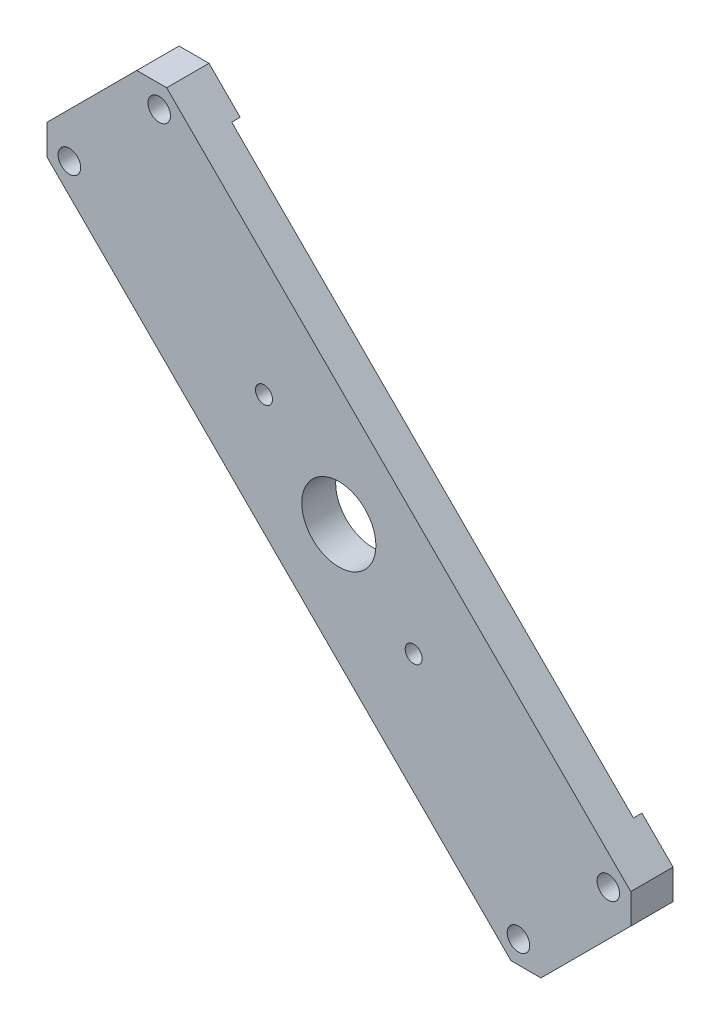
ISO-10303-21;
HEADER;
FILE_DESCRIPTION(('STEP AP214'),'2;1');
FILE_NAME('part.step','',(''),(''),'','','');
FILE_SCHEMA(('AUTOMOTIVE_DESIGN { 1 0 10303 214 1 1 1 1 }'));
ENDSEC;
DATA;
#1=APPLICATION_CONTEXT('core data for automotive mechanical design processes');
#2=APPLICATION_PROTOCOL_DEFINITION('international standard','automotive_design',2000,#1);
#3=PRODUCT_CONTEXT('',#1,'mechanical');
#4=PRODUCT('Part','Part','',(#3));
#5=PRODUCT_RELATED_PRODUCT_CATEGORY('part','',(#4));
#6=PRODUCT_DEFINITION_FORMATION('','',#4);
#7=PRODUCT_DEFINITION_CONTEXT('part definition',#1,'design');
#8=PRODUCT_DEFINITION('design','',#6,#7);
#9=PRODUCT_DEFINITION_SHAPE('','',#8);
#10=(LENGTH_UNIT() NAMED_UNIT(*) SI_UNIT(.MILLI.,.METRE.));
#11=(NAMED_UNIT(*) PLANE_ANGLE_UNIT() SI_UNIT($,.RADIAN.));
#12=(NAMED_UNIT(*) SI_UNIT($,.STERADIAN.) SOLID_ANGLE_UNIT());
#13=UNCERTAINTY_MEASURE_WITH_UNIT(LENGTH_MEASURE(1.E-05),#10,'distance_accuracy_value','');
#14=(GEOMETRIC_REPRESENTATION_CONTEXT(3) GLOBAL_UNCERTAINTY_ASSIGNED_CONTEXT((#13)) GLOBAL_UNIT_ASSIGNED_CONTEXT((#10,
#11,#12)) REPRESENTATION_CONTEXT('',''));
#15=CARTESIAN_POINT('',(0.,0.,0.));
#16=DIRECTION('',(0.,0.,1.));
#17=DIRECTION('',(1.,0.,0.));
#18=AXIS2_PLACEMENT_3D('',#15,#16,#17);
#19=CARTESIAN_POINT('',(-157.218600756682,-9.55237475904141,0.));
#20=DIRECTION('',(0.,0.,-1.));
#21=DIRECTION('',(-1.,0.,0.));
#22=AXIS2_PLACEMENT_3D('',#19,#20,#21);
#23=PLANE('',#22);
#24=DIRECTION('',(0.707106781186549,-0.707106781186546,0.));
#25=VECTOR('',#24,1.);
#26=CARTESIAN_POINT('',(-44.9653992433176,-193.647625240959,0.));
#27=LINE('',#26,#25);
#28=CARTESIAN_POINT('',(-188.649497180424,-49.9635273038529,0.));
#29=VERTEX_POINT('',#28);
#30=CARTESIAN_POINT('',(-179.293901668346,-59.3191228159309,0.));
#31=VERTEX_POINT('',#30);
#32=EDGE_CURVE('E135',#29,#31,#27,.T.);
#33=ORIENTED_EDGE('',*,*,#32,.F.);
#34=DIRECTION('',(0.,-1.,0.));
#35=VECTOR('',#34,1.);
#36=CARTESIAN_POINT('',(-188.649497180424,-9.55237475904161,0.));
#37=LINE('',#36,#35);
#38=CARTESIAN_POINT('',(-188.649497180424,-40.9832711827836,0.));
#39=VERTEX_POINT('',#38);
#40=EDGE_CURVE('E68',#29,#39,#37,.F.);
#41=ORIENTED_EDGE('',*,*,#40,.T.);
#42=DIRECTION('',(-0.707106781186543,-0.707106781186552,0.));
#43=VECTOR('',#42,1.);
#44=CARTESIAN_POINT('',(-193.139625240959,-45.4733992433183,0.));
#45=LINE('',#44,#43);
#46=CARTESIAN_POINT('',(-161.708728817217,-14.042502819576,0.));
#47=VERTEX_POINT('',#46);
#48=EDGE_CURVE('E199',#47,#39,#45,.T.);
#49=ORIENTED_EDGE('',*,*,#48,.F.);
#50=DIRECTION('',(-1.,0.,0.));
#51=VECTOR('',#50,1.);
#52=CARTESIAN_POINT('',(-157.218600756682,-14.042502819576,0.));
#53=LINE('',#52,#51);
#54=CARTESIAN_POINT('',(-152.728472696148,-14.042502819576,0.));
#55=VERTEX_POINT('',#54);
#56=EDGE_CURVE('E62',#47,#55,#53,.F.);
#57=ORIENTED_EDGE('',*,*,#56,.T.);
#58=DIRECTION('',(-0.707106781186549,0.707106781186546,0.));
#59=VECTOR('',#58,1.);
#60=CARTESIAN_POINT('',(-157.218600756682,-9.55237475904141,0.));
#61=LINE('',#60,#59);
#62=CARTESIAN_POINT('',(-143.372877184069,-23.3980983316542,0.));
#63=VERTEX_POINT('',#62);
#64=EDGE_CURVE('E159',#63,#55,#61,.T.);
#65=ORIENTED_EDGE('',*,*,#64,.F.);
#66=CARTESIAN_POINT('',(-101.092,-101.6,0.));
#67=DIRECTION('',(0.,0.,-1.));
#68=DIRECTION('',(-1.,0.,0.));
#69=AXIS2_PLACEMENT_3D('',#66,#67,#68);
#70=CIRCLE('',#69,88.9);
#71=EDGE_CURVE('E152',#31,#63,#70,.T.);
#72=ORIENTED_EDGE('',*,*,#71,.F.);
#73=EDGE_LOOP('',(#33,#41,#49,#57,#65,#72));
#74=FACE_BOUND('',#73,.T.);
#75=CARTESIAN_POINT('',(-181.914305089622,-47.7184632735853,0.));
#76=DIRECTION('',(0.,0.,1.));
#77=DIRECTION('',(1.,0.,0.));
#78=AXIS2_PLACEMENT_3D('',#75,#76,#77);
#79=CIRCLE('',#78,3.37819999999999);
#80=CARTESIAN_POINT('',(-178.536105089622,-47.7184632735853,0.));
#81=VERTEX_POINT('',#80);
#82=EDGE_CURVE('E193',#81,#81,#79,.T.);
#83=ORIENTED_EDGE('',*,*,#82,.T.);
#84=EDGE_LOOP('',(#83));
#85=FACE_BOUND('',#84,.T.);
#86=CARTESIAN_POINT('',(-154.973536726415,-20.7776949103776,0.));
#87=DIRECTION('',(0.,0.,1.));
#88=DIRECTION('',(1.,0.,0.));
#89=AXIS2_PLACEMENT_3D('',#86,#87,#88);
#90=CIRCLE('',#89,3.37819999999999);
#91=CARTESIAN_POINT('',(-151.595336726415,-20.7776949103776,0.));
#92=VERTEX_POINT('',#91);
#93=EDGE_CURVE('E187',#92,#92,#90,.T.);
#94=ORIENTED_EDGE('',*,*,#93,.T.);
#95=EDGE_LOOP('',(#94));
#96=FACE_BOUND('',#95,.T.);
#97=ADVANCED_FACE('F45',(#74,#85,#96),#23,.T.);
#98=CARTESIAN_POINT('',(-101.092,-101.6,12.7));
#99=DIRECTION('',(0.,0.,-1.));
#100=DIRECTION('',(-1.,0.,0.));
#101=AXIS2_PLACEMENT_3D('',#98,#99,#100);
#102=CYLINDRICAL_SURFACE('',#101,11.1124999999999);
#103=CARTESIAN_POINT('',(-101.092,-101.6,12.7));
#104=DIRECTION('',(0.,0.,1.));
#105=DIRECTION('',(1.,0.,0.));
#106=AXIS2_PLACEMENT_3D('',#103,#104,#105);
#107=CIRCLE('',#106,11.1124999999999);
#108=CARTESIAN_POINT('',(-89.9794999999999,-101.6,12.7));
#109=VERTEX_POINT('',#108);
#110=EDGE_CURVE('E174',#109,#109,#107,.T.);
#111=ORIENTED_EDGE('',*,*,#110,.T.);
#112=EDGE_LOOP('',(#111));
#113=FACE_BOUND('',#112,.T.);
#114=CARTESIAN_POINT('',(-101.092,-101.6,2.54));
#115=DIRECTION('',(0.,0.,-1.));
#116=DIRECTION('',(-1.,0.,0.));
#117=AXIS2_PLACEMENT_3D('',#114,#115,#116);
#118=CIRCLE('',#117,11.1124999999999);
#119=CARTESIAN_POINT('',(-112.2045,-101.6,2.54));
#120=VERTEX_POINT('',#119);
#121=EDGE_CURVE('E170',#120,#120,#118,.T.);
#122=ORIENTED_EDGE('',*,*,#121,.T.);
#123=EDGE_LOOP('',(#122));
#124=FACE_BOUND('',#123,.T.);
#125=ADVANCED_FACE('F353',(#113,#124),#102,.F.);
#126=CARTESIAN_POINT('',(-157.218600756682,-9.55237475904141,12.7));
#127=DIRECTION('',(0.,0.,-1.));
#128=DIRECTION('',(-1.,0.,0.));
#129=AXIS2_PLACEMENT_3D('',#126,#127,#128);
#130=PLANE('',#129);
#131=CARTESIAN_POINT('',(-123.542640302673,-79.1493596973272,12.7));
#132=DIRECTION('',(0.,0.,1.));
#133=DIRECTION('',(1.,0.,0.));
#134=AXIS2_PLACEMENT_3D('',#131,#132,#133);
#135=CIRCLE('',#134,2.55269999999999);
#136=CARTESIAN_POINT('',(-120.989940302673,-79.1493596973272,12.7));
#137=VERTEX_POINT('',#136);
#138=EDGE_CURVE('E267',#137,#137,#135,.T.);
#139=ORIENTED_EDGE('',*,*,#138,.F.);
#140=EDGE_LOOP('',(#139));
#141=FACE_BOUND('',#140,.T.);
#142=CARTESIAN_POINT('',(-78.641359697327,-124.050640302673,12.7));
#143=DIRECTION('',(0.,0.,1.));
#144=DIRECTION('',(1.,0.,0.));
#145=AXIS2_PLACEMENT_3D('',#142,#143,#144);
#146=CIRCLE('',#145,2.55269999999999);
#147=CARTESIAN_POINT('',(-76.088659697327,-124.050640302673,12.7));
#148=VERTEX_POINT('',#147);
#149=EDGE_CURVE('E257',#148,#148,#146,.T.);
#150=ORIENTED_EDGE('',*,*,#149,.F.);
#151=EDGE_LOOP('',(#150));
#152=FACE_BOUND('',#151,.T.);
#153=DIRECTION('',(0.707106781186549,-0.707106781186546,0.));
#154=VECTOR('',#153,1.);
#155=CARTESIAN_POINT('',(-44.9653992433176,-193.647625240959,12.7));
#156=LINE('',#155,#154);
#157=CARTESIAN_POINT('',(-188.649497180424,-49.9635273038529,12.7));
#158=VERTEX_POINT('',#157);
#159=CARTESIAN_POINT('',(-49.4555273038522,-189.157497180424,12.7));
#160=VERTEX_POINT('',#159);
#161=EDGE_CURVE('E205',#158,#160,#156,.T.);
#162=ORIENTED_EDGE('',*,*,#161,.T.);
#163=DIRECTION('',(-1.,0.,0.));
#164=VECTOR('',#163,1.);
#165=CARTESIAN_POINT('',(-40.475271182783,-189.157497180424,12.7));
#166=LINE('',#165,#164);
#167=CARTESIAN_POINT('',(-40.475271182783,-189.157497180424,12.7));
#168=VERTEX_POINT('',#167);
#169=EDGE_CURVE('E244',#160,#168,#166,.F.);
#170=ORIENTED_EDGE('',*,*,#169,.T.);
#171=DIRECTION('',(0.707106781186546,0.707106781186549,0.));
#172=VECTOR('',#171,1.);
#173=CARTESIAN_POINT('',(-9.04437475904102,-157.726600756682,12.7));
#174=LINE('',#173,#172);
#175=CARTESIAN_POINT('',(-13.5345028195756,-162.216728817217,12.7));
#176=VERTEX_POINT('',#175);
#177=EDGE_CURVE('E209',#168,#176,#174,.T.);
#178=ORIENTED_EDGE('',*,*,#177,.T.);
#179=DIRECTION('',(0.,-1.,0.));
#180=VECTOR('',#179,1.);
#181=CARTESIAN_POINT('',(-13.5345028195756,-153.236472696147,12.7));
#182=LINE('',#181,#180);
#183=CARTESIAN_POINT('',(-13.5345028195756,-153.236472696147,12.7));
#184=VERTEX_POINT('',#183);
#185=EDGE_CURVE('E238',#176,#184,#182,.F.);
#186=ORIENTED_EDGE('',*,*,#185,.T.);
#187=DIRECTION('',(-0.707106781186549,0.707106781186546,0.));
#188=VECTOR('',#187,1.);
#189=CARTESIAN_POINT('',(-157.218600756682,-9.55237475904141,12.7));
#190=LINE('',#189,#188);
#191=CARTESIAN_POINT('',(-152.728472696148,-14.042502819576,12.7));
#192=VERTEX_POINT('',#191);
#193=EDGE_CURVE('E212',#184,#192,#190,.T.);
#194=ORIENTED_EDGE('',*,*,#193,.T.);
#195=DIRECTION('',(1.,0.,0.));
#196=VECTOR('',#195,1.);
#197=CARTESIAN_POINT('',(-161.708728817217,-14.042502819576,12.7));
#198=LINE('',#197,#196);
#199=CARTESIAN_POINT('',(-161.708728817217,-14.042502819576,12.7));
#200=VERTEX_POINT('',#199);
#201=EDGE_CURVE('E240',#192,#200,#198,.F.);
#202=ORIENTED_EDGE('',*,*,#201,.T.);
#203=DIRECTION('',(-0.707106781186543,-0.707106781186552,0.));
#204=VECTOR('',#203,1.);
#205=CARTESIAN_POINT('',(-193.139625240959,-45.4733992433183,12.7));
#206=LINE('',#205,#204);
#207=CARTESIAN_POINT('',(-188.649497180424,-40.9832711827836,12.7));
#208=VERTEX_POINT('',#207);
#209=EDGE_CURVE('E202',#200,#208,#206,.T.);
#210=ORIENTED_EDGE('',*,*,#209,.T.);
#211=DIRECTION('',(0.,1.,0.));
#212=VECTOR('',#211,1.);
#213=CARTESIAN_POINT('',(-188.649497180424,-49.9635273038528,12.7));
#214=LINE('',#213,#212);
#215=EDGE_CURVE('E242',#208,#158,#214,.F.);
#216=ORIENTED_EDGE('',*,*,#215,.T.);
#217=EDGE_LOOP('',(#162,#170,#178,#186,#194,#202,#210,#216));
#218=FACE_BOUND('',#217,.T.);
#219=CARTESIAN_POINT('',(-181.914305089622,-47.7184632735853,12.7));
#220=DIRECTION('',(0.,0.,1.));
#221=DIRECTION('',(1.,0.,0.));
#222=AXIS2_PLACEMENT_3D('',#219,#220,#221);
#223=CIRCLE('',#222,3.37819999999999);
#224=CARTESIAN_POINT('',(-178.536105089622,-47.7184632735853,12.7));
#225=VERTEX_POINT('',#224);
#226=EDGE_CURVE('E196',#225,#225,#223,.T.);
#227=ORIENTED_EDGE('',*,*,#226,.F.);
#228=EDGE_LOOP('',(#227));
#229=FACE_BOUND('',#228,.T.);
#230=CARTESIAN_POINT('',(-154.973536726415,-20.7776949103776,12.7));
#231=DIRECTION('',(0.,0.,1.));
#232=DIRECTION('',(1.,0.,0.));
#233=AXIS2_PLACEMENT_3D('',#230,#231,#232);
#234=CIRCLE('',#233,3.37819999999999);
#235=CARTESIAN_POINT('',(-151.595336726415,-20.7776949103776,12.7));
#236=VERTEX_POINT('',#235);
#237=EDGE_CURVE('E190',#236,#236,#234,.T.);
#238=ORIENTED_EDGE('',*,*,#237,.F.);
#239=EDGE_LOOP('',(#238));
#240=FACE_BOUND('',#239,.T.);
#241=CARTESIAN_POINT('',(-47.2104632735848,-182.422305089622,12.7));
#242=DIRECTION('',(0.,0.,1.));
#243=DIRECTION('',(1.,0.,0.));
#244=AXIS2_PLACEMENT_3D('',#241,#242,#243);
#245=CIRCLE('',#244,3.3782);
#246=CARTESIAN_POINT('',(-43.8322632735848,-182.422305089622,12.7));
#247=VERTEX_POINT('',#246);
#248=EDGE_CURVE('E184',#247,#247,#245,.T.);
#249=ORIENTED_EDGE('',*,*,#248,.F.);
#250=EDGE_LOOP('',(#249));
#251=FACE_BOUND('',#250,.T.);
#252=CARTESIAN_POINT('',(-20.2696949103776,-155.481536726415,12.7));
#253=DIRECTION('',(0.,0.,1.));
#254=DIRECTION('',(1.,0.,0.));
#255=AXIS2_PLACEMENT_3D('',#252,#253,#254);
#256=CIRCLE('',#255,3.37819999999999);
#257=CARTESIAN_POINT('',(-16.8914949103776,-155.481536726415,12.7));
#258=VERTEX_POINT('',#257);
#259=EDGE_CURVE('E178',#258,#258,#256,.T.);
#260=ORIENTED_EDGE('',*,*,#259,.F.);
#261=EDGE_LOOP('',(#260));
#262=FACE_BOUND('',#261,.T.);
#263=ORIENTED_EDGE('',*,*,#110,.F.);
#264=EDGE_LOOP('',(#263));
#265=FACE_BOUND('',#264,.T.);
#266=ADVANCED_FACE('F325',(#141,#152,#218,#229,#240,#251,#262,#265),#130,.F.);
#267=DIRECTION('',(0.707106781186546,0.707106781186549,0.));
#268=VECTOR('',#267,1.);
#269=CARTESIAN_POINT('',(-9.04437475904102,-157.726600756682,0.));
#270=LINE('',#269,#268);
#271=CARTESIAN_POINT('',(-40.475271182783,-189.157497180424,0.));
#272=VERTEX_POINT('',#271);
#273=CARTESIAN_POINT('',(-13.5345028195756,-162.216728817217,0.));
#274=VERTEX_POINT('',#273);
#275=EDGE_CURVE('E145',#272,#274,#270,.T.);
#276=ORIENTED_EDGE('',*,*,#275,.F.);
#277=DIRECTION('',(1.,0.,0.));
#278=VECTOR('',#277,1.);
#279=CARTESIAN_POINT('',(-157.218600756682,-189.157497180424,0.));
#280=LINE('',#279,#278);
#281=CARTESIAN_POINT('',(-49.4555273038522,-189.157497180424,0.));
#282=VERTEX_POINT('',#281);
#283=EDGE_CURVE('E233',#272,#282,#280,.F.);
#284=ORIENTED_EDGE('',*,*,#283,.T.);
#285=CARTESIAN_POINT('',(-58.8111228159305,-179.801901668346,0.));
#286=VERTEX_POINT('',#285);
#287=EDGE_CURVE('E146',#286,#282,#27,.T.);
#288=ORIENTED_EDGE('',*,*,#287,.F.);
#289=CARTESIAN_POINT('',(-22.890098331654,-143.880877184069,0.));
#290=VERTEX_POINT('',#289);
#291=EDGE_CURVE('E161',#290,#286,#70,.T.);
#292=ORIENTED_EDGE('',*,*,#291,.F.);
#293=CARTESIAN_POINT('',(-13.5345028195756,-153.236472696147,0.));
#294=VERTEX_POINT('',#293);
#295=EDGE_CURVE('E206',#294,#290,#61,.T.);
#296=ORIENTED_EDGE('',*,*,#295,.F.);
#297=DIRECTION('',(0.,1.,0.));
#298=VECTOR('',#297,1.);
#299=CARTESIAN_POINT('',(-13.5345028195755,-9.55237475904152,0.));
#300=LINE('',#299,#298);
#301=EDGE_CURVE('E231',#294,#274,#300,.F.);
#302=ORIENTED_EDGE('',*,*,#301,.T.);
#303=EDGE_LOOP('',(#276,#284,#288,#292,#296,#302));
#304=FACE_BOUND('',#303,.T.);
#305=CARTESIAN_POINT('',(-20.2696949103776,-155.481536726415,0.));
#306=DIRECTION('',(0.,0.,1.));
#307=DIRECTION('',(1.,0.,0.));
#308=AXIS2_PLACEMENT_3D('',#305,#306,#307);
#309=CIRCLE('',#308,3.37819999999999);
#310=CARTESIAN_POINT('',(-16.8914949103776,-155.481536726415,0.));
#311=VERTEX_POINT('',#310);
#312=EDGE_CURVE('E177',#311,#311,#309,.T.);
#313=ORIENTED_EDGE('',*,*,#312,.T.);
#314=EDGE_LOOP('',(#313));
#315=FACE_BOUND('',#314,.T.);
#316=CARTESIAN_POINT('',(-47.2104632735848,-182.422305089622,0.));
#317=DIRECTION('',(0.,0.,1.));
#318=DIRECTION('',(1.,0.,0.));
#319=AXIS2_PLACEMENT_3D('',#316,#317,#318);
#320=CIRCLE('',#319,3.3782);
#321=CARTESIAN_POINT('',(-43.8322632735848,-182.422305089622,0.));
#322=VERTEX_POINT('',#321);
#323=EDGE_CURVE('E181',#322,#322,#320,.T.);
#324=ORIENTED_EDGE('',*,*,#323,.T.);
#325=EDGE_LOOP('',(#324));
#326=FACE_BOUND('',#325,.T.);
#327=ADVANCED_FACE('F313',(#304,#315,#326),#23,.T.);
#328=CARTESIAN_POINT('',(-193.139625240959,-45.4733992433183,12.7));
#329=DIRECTION('',(0.707106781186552,-0.707106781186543,0.));
#330=DIRECTION('',(0.707106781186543,0.707106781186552,0.));
#331=AXIS2_PLACEMENT_3D('',#328,#329,#330);
#332=PLANE('',#331);
#333=ORIENTED_EDGE('',*,*,#48,.T.);
#334=DIRECTION('',(0.,0.,1.));
#335=VECTOR('',#334,1.);
#336=CARTESIAN_POINT('',(-188.649497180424,-40.9832711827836,12.7));
#337=LINE('',#336,#335);
#338=EDGE_CURVE('E251',#39,#208,#337,.T.);
#339=ORIENTED_EDGE('',*,*,#338,.T.);
#340=ORIENTED_EDGE('',*,*,#209,.F.);
#341=DIRECTION('',(0.,0.,-1.));
#342=VECTOR('',#341,1.);
#343=CARTESIAN_POINT('',(-161.708728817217,-14.042502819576,12.7));
#344=LINE('',#343,#342);
#345=EDGE_CURVE('E248',#200,#47,#344,.T.);
#346=ORIENTED_EDGE('',*,*,#345,.T.);
#347=EDGE_LOOP('',(#333,#339,#340,#346));
#348=FACE_BOUND('',#347,.T.);
#349=ADVANCED_FACE('F340',(#348),#332,.F.);
#350=CARTESIAN_POINT('',(-44.9653992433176,-193.647625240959,12.7));
#351=DIRECTION('',(0.707106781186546,0.707106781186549,0.));
#352=DIRECTION('',(-0.707106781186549,0.707106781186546,0.));
#353=AXIS2_PLACEMENT_3D('',#350,#351,#352);
#354=PLANE('',#353);
#355=ORIENTED_EDGE('',*,*,#287,.T.);
#356=DIRECTION('',(0.,0.,1.));
#357=VECTOR('',#356,1.);
#358=CARTESIAN_POINT('',(-49.4555273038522,-189.157497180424,12.7));
#359=LINE('',#358,#357);
#360=EDGE_CURVE('E236',#282,#160,#359,.T.);
#361=ORIENTED_EDGE('',*,*,#360,.T.);
#362=ORIENTED_EDGE('',*,*,#161,.F.);
#363=DIRECTION('',(0.,0.,-1.));
#364=VECTOR('',#363,1.);
#365=CARTESIAN_POINT('',(-188.649497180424,-49.9635273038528,12.7));
#366=LINE('',#365,#364);
#367=EDGE_CURVE('E143',#158,#29,#366,.T.);
#368=ORIENTED_EDGE('',*,*,#367,.T.);
#369=ORIENTED_EDGE('',*,*,#32,.T.);
#370=DIRECTION('',(0.,0.,-1.));
#371=VECTOR('',#370,1.);
#372=CARTESIAN_POINT('',(-179.293901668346,-59.3191228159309,2.54));
#373=LINE('',#372,#371);
#374=CARTESIAN_POINT('',(-179.293901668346,-59.3191228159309,2.54));
#375=VERTEX_POINT('',#374);
#376=EDGE_CURVE('E140',#31,#375,#373,.F.);
#377=ORIENTED_EDGE('',*,*,#376,.T.);
#378=DIRECTION('',(-0.707106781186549,0.707106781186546,0.));
#379=VECTOR('',#378,1.);
#380=CARTESIAN_POINT('',(-44.9653992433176,-193.647625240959,2.54));
#381=LINE('',#380,#379);
#382=CARTESIAN_POINT('',(-58.8111228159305,-179.801901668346,2.54));
#383=VERTEX_POINT('',#382);
#384=EDGE_CURVE('E156',#383,#375,#381,.T.);
#385=ORIENTED_EDGE('',*,*,#384,.F.);
#386=DIRECTION('',(0.,0.,-1.));
#387=VECTOR('',#386,1.);
#388=CARTESIAN_POINT('',(-58.8111228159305,-179.801901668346,2.54));
#389=LINE('',#388,#387);
#390=EDGE_CURVE('E155',#383,#286,#389,.T.);
#391=ORIENTED_EDGE('',*,*,#390,.T.);
#392=EDGE_LOOP('',(#355,#361,#362,#368,#369,#377,#385,#391));
#393=FACE_BOUND('',#392,.T.);
#394=ADVANCED_FACE('F138',(#393),#354,.F.);
#395=CARTESIAN_POINT('',(-9.04437475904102,-157.726600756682,12.7));
#396=DIRECTION('',(-0.707106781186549,0.707106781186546,0.));
#397=DIRECTION('',(-0.707106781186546,-0.707106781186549,0.));
#398=AXIS2_PLACEMENT_3D('',#395,#396,#397);
#399=PLANE('',#398);
#400=ORIENTED_EDGE('',*,*,#177,.F.);
#401=DIRECTION('',(0.,0.,-1.));
#402=VECTOR('',#401,1.);
#403=CARTESIAN_POINT('',(-40.475271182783,-189.157497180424,12.7));
#404=LINE('',#403,#402);
#405=EDGE_CURVE('E228',#168,#272,#404,.T.);
#406=ORIENTED_EDGE('',*,*,#405,.T.);
#407=ORIENTED_EDGE('',*,*,#275,.T.);
#408=DIRECTION('',(0.,0.,1.));
#409=VECTOR('',#408,1.);
#410=CARTESIAN_POINT('',(-13.5345028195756,-162.216728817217,12.7));
#411=LINE('',#410,#409);
#412=EDGE_CURVE('E226',#274,#176,#411,.T.);
#413=ORIENTED_EDGE('',*,*,#412,.T.);
#414=EDGE_LOOP('',(#400,#406,#407,#413));
#415=FACE_BOUND('',#414,.T.);
#416=ADVANCED_FACE('F321',(#415),#399,.F.);
#417=CARTESIAN_POINT('',(-157.218600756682,-9.55237475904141,12.7));
#418=DIRECTION('',(-0.707106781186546,-0.707106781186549,0.));
#419=DIRECTION('',(0.707106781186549,-0.707106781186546,0.));
#420=AXIS2_PLACEMENT_3D('',#417,#418,#419);
#421=PLANE('',#420);
#422=ORIENTED_EDGE('',*,*,#64,.T.);
#423=DIRECTION('',(0.,0.,1.));
#424=VECTOR('',#423,1.);
#425=CARTESIAN_POINT('',(-152.728472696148,-14.042502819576,12.7));
#426=LINE('',#425,#424);
#427=EDGE_CURVE('E11',#55,#192,#426,.T.);
#428=ORIENTED_EDGE('',*,*,#427,.T.);
#429=ORIENTED_EDGE('',*,*,#193,.F.);
#430=DIRECTION('',(0.,0.,-1.));
#431=VECTOR('',#430,1.);
#432=CARTESIAN_POINT('',(-13.5345028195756,-153.236472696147,12.7));
#433=LINE('',#432,#431);
#434=EDGE_CURVE('E54',#184,#294,#433,.T.);
#435=ORIENTED_EDGE('',*,*,#434,.T.);
#436=ORIENTED_EDGE('',*,*,#295,.T.);
#437=DIRECTION('',(0.,0.,-1.));
#438=VECTOR('',#437,1.);
#439=CARTESIAN_POINT('',(-22.890098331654,-143.880877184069,2.54));
#440=LINE('',#439,#438);
#441=CARTESIAN_POINT('',(-22.890098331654,-143.880877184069,2.54));
#442=VERTEX_POINT('',#441);
#443=EDGE_CURVE('E215',#290,#442,#440,.F.);
#444=ORIENTED_EDGE('',*,*,#443,.T.);
#445=DIRECTION('',(0.707106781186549,-0.707106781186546,0.));
#446=VECTOR('',#445,1.);
#447=CARTESIAN_POINT('',(-157.218600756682,-9.55237475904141,2.54));
#448=LINE('',#447,#446);
#449=CARTESIAN_POINT('',(-143.372877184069,-23.3980983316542,2.54));
#450=VERTEX_POINT('',#449);
#451=EDGE_CURVE('E168',#450,#442,#448,.T.);
#452=ORIENTED_EDGE('',*,*,#451,.F.);
#453=DIRECTION('',(0.,0.,-1.));
#454=VECTOR('',#453,1.);
#455=CARTESIAN_POINT('',(-143.372877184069,-23.3980983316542,2.54));
#456=LINE('',#455,#454);
#457=EDGE_CURVE('E224',#450,#63,#456,.T.);
#458=ORIENTED_EDGE('',*,*,#457,.T.);
#459=EDGE_LOOP('',(#422,#428,#429,#435,#436,#444,#452,#458));
#460=FACE_BOUND('',#459,.T.);
#461=ADVANCED_FACE('F331',(#460),#421,.F.);
#462=CARTESIAN_POINT('',(-181.914305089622,-47.7184632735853,12.7));
#463=DIRECTION('',(0.,0.,-1.));
#464=DIRECTION('',(-1.,0.,0.));
#465=AXIS2_PLACEMENT_3D('',#462,#463,#464);
#466=CYLINDRICAL_SURFACE('',#465,3.37819999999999);
#467=ORIENTED_EDGE('',*,*,#226,.T.);
#468=EDGE_LOOP('',(#467));
#469=FACE_BOUND('',#468,.T.);
#470=ORIENTED_EDGE('',*,*,#82,.F.);
#471=EDGE_LOOP('',(#470));
#472=FACE_BOUND('',#471,.T.);
#473=ADVANCED_FACE('F376',(#469,#472),#466,.F.);
#474=CARTESIAN_POINT('',(-154.973536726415,-20.7776949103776,12.7));
#475=DIRECTION('',(0.,0.,-1.));
#476=DIRECTION('',(-1.,0.,0.));
#477=AXIS2_PLACEMENT_3D('',#474,#475,#476);
#478=CYLINDRICAL_SURFACE('',#477,3.37819999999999);
#479=ORIENTED_EDGE('',*,*,#237,.T.);
#480=EDGE_LOOP('',(#479));
#481=FACE_BOUND('',#480,.T.);
#482=ORIENTED_EDGE('',*,*,#93,.F.);
#483=EDGE_LOOP('',(#482));
#484=FACE_BOUND('',#483,.T.);
#485=ADVANCED_FACE('F379',(#481,#484),#478,.F.);
#486=CARTESIAN_POINT('',(-47.2104632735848,-182.422305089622,12.7));
#487=DIRECTION('',(0.,0.,-1.));
#488=DIRECTION('',(-1.,0.,0.));
#489=AXIS2_PLACEMENT_3D('',#486,#487,#488);
#490=CYLINDRICAL_SURFACE('',#489,3.3782);
#491=ORIENTED_EDGE('',*,*,#248,.T.);
#492=EDGE_LOOP('',(#491));
#493=FACE_BOUND('',#492,.T.);
#494=ORIENTED_EDGE('',*,*,#323,.F.);
#495=EDGE_LOOP('',(#494));
#496=FACE_BOUND('',#495,.T.);
#497=ADVANCED_FACE('F383',(#493,#496),#490,.F.);
#498=CARTESIAN_POINT('',(-20.2696949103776,-155.481536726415,12.7));
#499=DIRECTION('',(0.,0.,-1.));
#500=DIRECTION('',(-1.,0.,0.));
#501=AXIS2_PLACEMENT_3D('',#498,#499,#500);
#502=CYLINDRICAL_SURFACE('',#501,3.37819999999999);
#503=ORIENTED_EDGE('',*,*,#259,.T.);
#504=EDGE_LOOP('',(#503));
#505=FACE_BOUND('',#504,.T.);
#506=ORIENTED_EDGE('',*,*,#312,.F.);
#507=EDGE_LOOP('',(#506));
#508=FACE_BOUND('',#507,.T.);
#509=ADVANCED_FACE('F387',(#505,#508),#502,.F.);
#510=CARTESIAN_POINT('',(-101.092,-101.6,2.54));
#511=DIRECTION('',(0.,0.,-1.));
#512=DIRECTION('',(-1.,0.,0.));
#513=AXIS2_PLACEMENT_3D('',#510,#511,#512);
#514=CYLINDRICAL_SURFACE('',#513,88.9);
#515=CARTESIAN_POINT('',(-101.092,-101.6,2.54));
#516=DIRECTION('',(0.,0.,-1.));
#517=DIRECTION('',(-1.,0.,0.));
#518=AXIS2_PLACEMENT_3D('',#515,#516,#517);
#519=CIRCLE('',#518,88.9);
#520=EDGE_CURVE('E160',#442,#383,#519,.T.);
#521=ORIENTED_EDGE('',*,*,#520,.F.);
#522=ORIENTED_EDGE('',*,*,#443,.F.);
#523=ORIENTED_EDGE('',*,*,#291,.T.);
#524=ORIENTED_EDGE('',*,*,#390,.F.);
#525=EDGE_LOOP('',(#521,#522,#523,#524));
#526=FACE_BOUND('',#525,.T.);
#527=ADVANCED_FACE('F390',(#526),#514,.F.);
#528=ORIENTED_EDGE('',*,*,#71,.T.);
#529=ORIENTED_EDGE('',*,*,#457,.F.);
#530=EDGE_CURVE('E154',#375,#450,#519,.T.);
#531=ORIENTED_EDGE('',*,*,#530,.F.);
#532=ORIENTED_EDGE('',*,*,#376,.F.);
#533=EDGE_LOOP('',(#528,#529,#531,#532));
#534=FACE_BOUND('',#533,.T.);
#535=ADVANCED_FACE('F150',(#534),#514,.F.);
#536=CARTESIAN_POINT('',(-101.092,-101.6,2.54));
#537=DIRECTION('',(0.,0.,-1.));
#538=DIRECTION('',(-1.,0.,0.));
#539=AXIS2_PLACEMENT_3D('',#536,#537,#538);
#540=PLANE('',#539);
#541=CARTESIAN_POINT('',(-123.542640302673,-79.1493596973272,2.54));
#542=DIRECTION('',(0.,0.,-1.));
#543=DIRECTION('',(-1.,0.,0.));
#544=AXIS2_PLACEMENT_3D('',#541,#542,#543);
#545=CIRCLE('',#544,2.55269999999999);
#546=CARTESIAN_POINT('',(-126.095340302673,-79.1493596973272,2.54));
#547=VERTEX_POINT('',#546);
#548=EDGE_CURVE('E49',#547,#547,#545,.T.);
#549=ORIENTED_EDGE('',*,*,#548,.F.);
#550=EDGE_LOOP('',(#549));
#551=FACE_BOUND('',#550,.T.);
#552=CARTESIAN_POINT('',(-78.641359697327,-124.050640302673,2.54));
#553=DIRECTION('',(0.,0.,-1.));
#554=DIRECTION('',(-1.,0.,0.));
#555=AXIS2_PLACEMENT_3D('',#552,#553,#554);
#556=CIRCLE('',#555,2.55269999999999);
#557=CARTESIAN_POINT('',(-81.194059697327,-124.050640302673,2.54));
#558=VERTEX_POINT('',#557);
#559=EDGE_CURVE('E254',#558,#558,#556,.T.);
#560=ORIENTED_EDGE('',*,*,#559,.F.);
#561=EDGE_LOOP('',(#560));
#562=FACE_BOUND('',#561,.T.);
#563=CARTESIAN_POINT('',(-134.767960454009,-45.4733992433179,2.54));
#564=DIRECTION('',(0.,0.,-1.));
#565=DIRECTION('',(-1.,0.,0.));
#566=AXIS2_PLACEMENT_3D('',#563,#564,#565);
#567=CIRCLE('',#566,4.06400000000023);
#568=CARTESIAN_POINT('',(-138.831960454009,-45.4733992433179,2.54));
#569=VERTEX_POINT('',#568);
#570=EDGE_CURVE('E272',#569,#569,#567,.T.);
#571=ORIENTED_EDGE('',*,*,#570,.F.);
#572=EDGE_LOOP('',(#571));
#573=FACE_BOUND('',#572,.T.);
#574=CARTESIAN_POINT('',(-157.218600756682,-67.9240395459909,2.54));
#575=DIRECTION('',(0.,0.,-1.));
#576=DIRECTION('',(-1.,0.,0.));
#577=AXIS2_PLACEMENT_3D('',#574,#575,#576);
#578=CIRCLE('',#577,4.06400000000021);
#579=CARTESIAN_POINT('',(-161.282600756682,-67.9240395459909,2.54));
#580=VERTEX_POINT('',#579);
#581=EDGE_CURVE('E278',#580,#580,#578,.T.);
#582=ORIENTED_EDGE('',*,*,#581,.F.);
#583=EDGE_LOOP('',(#582));
#584=FACE_BOUND('',#583,.T.);
#585=CARTESIAN_POINT('',(-44.9653992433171,-135.275960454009,2.54));
#586=DIRECTION('',(0.,0.,-1.));
#587=DIRECTION('',(-1.,0.,0.));
#588=AXIS2_PLACEMENT_3D('',#585,#586,#587);
#589=CIRCLE('',#588,4.06400000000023);
#590=CARTESIAN_POINT('',(-49.0293992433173,-135.275960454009,2.54));
#591=VERTEX_POINT('',#590);
#592=EDGE_CURVE('E284',#591,#591,#589,.T.);
#593=ORIENTED_EDGE('',*,*,#592,.F.);
#594=EDGE_LOOP('',(#593));
#595=FACE_BOUND('',#594,.T.);
#596=CARTESIAN_POINT('',(-67.4160395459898,-157.726600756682,2.54));
#597=DIRECTION('',(0.,0.,-1.));
#598=DIRECTION('',(-1.,0.,0.));
#599=AXIS2_PLACEMENT_3D('',#596,#597,#598);
#600=CIRCLE('',#599,4.06400000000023);
#601=CARTESIAN_POINT('',(-71.4800395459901,-157.726600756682,2.54));
#602=VERTEX_POINT('',#601);
#603=EDGE_CURVE('E256',#602,#602,#600,.T.);
#604=ORIENTED_EDGE('',*,*,#603,.F.);
#605=EDGE_LOOP('',(#604));
#606=FACE_BOUND('',#605,.T.);
#607=ORIENTED_EDGE('',*,*,#121,.F.);
#608=EDGE_LOOP('',(#607));
#609=FACE_BOUND('',#608,.T.);
#610=ORIENTED_EDGE('',*,*,#384,.T.);
#611=ORIENTED_EDGE('',*,*,#530,.T.);
#612=ORIENTED_EDGE('',*,*,#451,.T.);
#613=ORIENTED_EDGE('',*,*,#520,.T.);
#614=EDGE_LOOP('',(#610,#611,#612,#613));
#615=FACE_BOUND('',#614,.T.);
#616=ADVANCED_FACE('F298',(#551,#562,#573,#584,#595,#606,#609,#615),#540,.T.);
#617=CARTESIAN_POINT('',(-40.475271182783,-189.157497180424,12.7));
#618=DIRECTION('',(0.,1.,0.));
#619=DIRECTION('',(0.,0.,1.));
#620=AXIS2_PLACEMENT_3D('',#617,#618,#619);
#621=PLANE('',#620);
#622=ORIENTED_EDGE('',*,*,#169,.F.);
#623=ORIENTED_EDGE('',*,*,#360,.F.);
#624=ORIENTED_EDGE('',*,*,#283,.F.);
#625=ORIENTED_EDGE('',*,*,#405,.F.);
#626=EDGE_LOOP('',(#622,#623,#624,#625));
#627=FACE_BOUND('',#626,.T.);
#628=ADVANCED_FACE('F301',(#627),#621,.F.);
#629=CARTESIAN_POINT('',(-188.649497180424,-49.9635273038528,12.7));
#630=DIRECTION('',(1.,0.,0.));
#631=DIRECTION('',(0.,1.,0.));
#632=AXIS2_PLACEMENT_3D('',#629,#630,#631);
#633=PLANE('',#632);
#634=ORIENTED_EDGE('',*,*,#215,.F.);
#635=ORIENTED_EDGE('',*,*,#338,.F.);
#636=ORIENTED_EDGE('',*,*,#40,.F.);
#637=ORIENTED_EDGE('',*,*,#367,.F.);
#638=EDGE_LOOP('',(#634,#635,#636,#637));
#639=FACE_BOUND('',#638,.T.);
#640=ADVANCED_FACE('F344',(#639),#633,.F.);
#641=CARTESIAN_POINT('',(-161.708728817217,-14.042502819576,12.7));
#642=DIRECTION('',(0.,-1.,0.));
#643=DIRECTION('',(0.,0.,-1.));
#644=AXIS2_PLACEMENT_3D('',#641,#642,#643);
#645=PLANE('',#644);
#646=ORIENTED_EDGE('',*,*,#201,.F.);
#647=ORIENTED_EDGE('',*,*,#427,.F.);
#648=ORIENTED_EDGE('',*,*,#56,.F.);
#649=ORIENTED_EDGE('',*,*,#345,.F.);
#650=EDGE_LOOP('',(#646,#647,#648,#649));
#651=FACE_BOUND('',#650,.T.);
#652=ADVANCED_FACE('F338',(#651),#645,.F.);
#653=CARTESIAN_POINT('',(-13.5345028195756,-153.236472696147,12.7));
#654=DIRECTION('',(-1.,0.,0.));
#655=DIRECTION('',(0.,-1.,0.));
#656=AXIS2_PLACEMENT_3D('',#653,#654,#655);
#657=PLANE('',#656);
#658=ORIENTED_EDGE('',*,*,#185,.F.);
#659=ORIENTED_EDGE('',*,*,#412,.F.);
#660=ORIENTED_EDGE('',*,*,#301,.F.);
#661=ORIENTED_EDGE('',*,*,#434,.F.);
#662=EDGE_LOOP('',(#658,#659,#660,#661));
#663=FACE_BOUND('',#662,.T.);
#664=ADVANCED_FACE('F47',(#663),#657,.F.);
#665=CARTESIAN_POINT('',(-67.4160395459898,-157.726600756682,3.302));
#666=DIRECTION('',(0.,0.,-1.));
#667=DIRECTION('',(-1.,0.,0.));
#668=AXIS2_PLACEMENT_3D('',#665,#666,#667);
#669=CYLINDRICAL_SURFACE('',#668,4.06400000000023);
#670=CARTESIAN_POINT('',(-67.4160395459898,-157.726600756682,3.302));
#671=DIRECTION('',(0.,0.,-1.));
#672=DIRECTION('',(-1.,0.,0.));
#673=AXIS2_PLACEMENT_3D('',#670,#671,#672);
#674=CIRCLE('',#673,4.06400000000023);
#675=CARTESIAN_POINT('',(-71.4800395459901,-157.726600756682,3.302));
#676=VERTEX_POINT('',#675);
#677=EDGE_CURVE('E261',#676,#676,#674,.T.);
#678=CARTESIAN_POINT('',(-71.4800395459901,-157.726600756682,3.302));
#679=CARTESIAN_POINT('',(-71.4800395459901,-157.726600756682,3.2940625));
#680=CARTESIAN_POINT('',(-71.4800395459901,-157.726600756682,3.286125));
#681=CARTESIAN_POINT('',(-71.4800395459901,-157.726600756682,3.27025));
#682=CARTESIAN_POINT('',(-71.4800395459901,-157.726600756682,3.2623125));
#683=CARTESIAN_POINT('',(-71.4800395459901,-157.726600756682,3.2464375));
#684=CARTESIAN_POINT('',(-71.4800395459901,-157.726600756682,3.2385));
#685=CARTESIAN_POINT('',(-71.4800395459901,-157.726600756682,3.222625));
#686=CARTESIAN_POINT('',(-71.4800395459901,-157.726600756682,3.2146875));
#687=CARTESIAN_POINT('',(-71.4800395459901,-157.726600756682,3.1988125));
#688=CARTESIAN_POINT('',(-71.4800395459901,-157.726600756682,3.190875));
#689=CARTESIAN_POINT('',(-71.4800395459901,-157.726600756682,3.175));
#690=CARTESIAN_POINT('',(-71.4800395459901,-157.726600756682,3.1670625));
#691=CARTESIAN_POINT('',(-71.4800395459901,-157.726600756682,3.1511875));
#692=CARTESIAN_POINT('',(-71.4800395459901,-157.726600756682,3.14325));
#693=CARTESIAN_POINT('',(-71.4800395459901,-157.726600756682,3.127375));
#694=CARTESIAN_POINT('',(-71.4800395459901,-157.726600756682,3.1194375));
#695=CARTESIAN_POINT('',(-71.4800395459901,-157.726600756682,3.1035625));
#696=CARTESIAN_POINT('',(-71.4800395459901,-157.726600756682,3.095625));
#697=CARTESIAN_POINT('',(-71.4800395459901,-157.726600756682,3.07975));
#698=CARTESIAN_POINT('',(-71.4800395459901,-157.726600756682,3.0718125));
#699=CARTESIAN_POINT('',(-71.4800395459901,-157.726600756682,3.0559375));
#700=CARTESIAN_POINT('',(-71.4800395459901,-157.726600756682,3.048));
#701=CARTESIAN_POINT('',(-71.4800395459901,-157.726600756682,3.032125));
#702=CARTESIAN_POINT('',(-71.4800395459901,-157.726600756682,3.0241875));
#703=CARTESIAN_POINT('',(-71.4800395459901,-157.726600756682,3.0083125));
#704=CARTESIAN_POINT('',(-71.4800395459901,-157.726600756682,3.000375));
#705=CARTESIAN_POINT('',(-71.4800395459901,-157.726600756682,2.9845));
#706=CARTESIAN_POINT('',(-71.4800395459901,-157.726600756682,2.9765625));
#707=CARTESIAN_POINT('',(-71.4800395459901,-157.726600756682,2.9606875));
#708=CARTESIAN_POINT('',(-71.4800395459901,-157.726600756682,2.95275));
#709=CARTESIAN_POINT('',(-71.4800395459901,-157.726600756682,2.936875));
#710=CARTESIAN_POINT('',(-71.4800395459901,-157.726600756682,2.9289375));
#711=CARTESIAN_POINT('',(-71.4800395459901,-157.726600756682,2.9130625));
#712=CARTESIAN_POINT('',(-71.4800395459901,-157.726600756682,2.905125));
#713=CARTESIAN_POINT('',(-71.4800395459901,-157.726600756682,2.88925));
#714=CARTESIAN_POINT('',(-71.4800395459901,-157.726600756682,2.8813125));
#715=CARTESIAN_POINT('',(-71.4800395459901,-157.726600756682,2.8654375));
#716=CARTESIAN_POINT('',(-71.4800395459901,-157.726600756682,2.8575));
#717=CARTESIAN_POINT('',(-71.4800395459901,-157.726600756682,2.841625));
#718=CARTESIAN_POINT('',(-71.4800395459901,-157.726600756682,2.8336875));
#719=CARTESIAN_POINT('',(-71.4800395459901,-157.726600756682,2.8178125));
#720=CARTESIAN_POINT('',(-71.4800395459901,-157.726600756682,2.809875));
#721=CARTESIAN_POINT('',(-71.4800395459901,-157.726600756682,2.794));
#722=CARTESIAN_POINT('',(-71.4800395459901,-157.726600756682,2.7860625));
#723=CARTESIAN_POINT('',(-71.4800395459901,-157.726600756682,2.7701875));
#724=CARTESIAN_POINT('',(-71.4800395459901,-157.726600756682,2.76225));
#725=CARTESIAN_POINT('',(-71.4800395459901,-157.726600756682,2.746375));
#726=CARTESIAN_POINT('',(-71.4800395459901,-157.726600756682,2.7384375));
#727=CARTESIAN_POINT('',(-71.4800395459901,-157.726600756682,2.7225625));
#728=CARTESIAN_POINT('',(-71.4800395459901,-157.726600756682,2.714625));
#729=CARTESIAN_POINT('',(-71.4800395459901,-157.726600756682,2.69875));
#730=CARTESIAN_POINT('',(-71.4800395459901,-157.726600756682,2.6908125));
#731=CARTESIAN_POINT('',(-71.4800395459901,-157.726600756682,2.6749375));
#732=CARTESIAN_POINT('',(-71.4800395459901,-157.726600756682,2.667));
#733=CARTESIAN_POINT('',(-71.4800395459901,-157.726600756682,2.651125));
#734=CARTESIAN_POINT('',(-71.4800395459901,-157.726600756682,2.6431875));
#735=CARTESIAN_POINT('',(-71.4800395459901,-157.726600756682,2.6273125));
#736=CARTESIAN_POINT('',(-71.4800395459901,-157.726600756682,2.619375));
#737=CARTESIAN_POINT('',(-71.4800395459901,-157.726600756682,2.6035));
#738=CARTESIAN_POINT('',(-71.4800395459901,-157.726600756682,2.5955625));
#739=CARTESIAN_POINT('',(-71.4800395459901,-157.726600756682,2.5796875));
#740=CARTESIAN_POINT('',(-71.4800395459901,-157.726600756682,2.57175));
#741=CARTESIAN_POINT('',(-71.4800395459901,-157.726600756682,2.555875));
#742=CARTESIAN_POINT('',(-71.4800395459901,-157.726600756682,2.5479375));
#743=CARTESIAN_POINT('',(-71.4800395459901,-157.726600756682,2.54));
#744=B_SPLINE_CURVE_WITH_KNOTS('',3,(#678,#679,#680,#681,#682,#683,#684,#685,#686,#687,#688,
#689,#690,#691,#692,#693,#694,#695,#696,#697,#698,#699,#700,#701,#702,#703,#704,#705,#706,#707,
#708,#709,#710,#711,#712,#713,#714,#715,#716,#717,#718,#719,#720,#721,#722,#723,#724,#725,#726,
#727,#728,#729,#730,#731,#732,#733,#734,#735,#736,#737,#738,#739,#740,#741,#742,#743),
.UNSPECIFIED.,.F.,.F.,(4,2,2,2,2,2,2,2,2,2,2,2,2,2,2,2,2,2,2,2,2,2,2,2,2,2,2,2,2,2,2,2,4),(0.,
0.0238125,0.0476249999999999,0.0714374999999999,0.0952499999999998,0.1190625,0.142875,0.1666875,
0.1905,0.2143125,0.238125,0.2619375,0.28575,0.3095625,0.333375,0.3571875,0.381,0.4048125,
0.428625,0.4524375,0.47625,0.5000625,0.523875,0.5476875,0.5715,0.5953125,0.619125,0.6429375,
0.66675,0.6905625,0.714375,0.7381875,0.762),.UNSPECIFIED.);
#745=EDGE_CURVE('BSEAM292',#676,#602,#744,.T.);
#746=ORIENTED_EDGE('',*,*,#677,.F.);
#747=ORIENTED_EDGE('',*,*,#603,.T.);
#748=ORIENTED_EDGE('',*,*,#745,.T.);
#749=ORIENTED_EDGE('',*,*,#745,.F.);
#750=EDGE_LOOP('',(#746,#748,#747,#749));
#751=FACE_BOUND('',#750,.T.);
#752=ADVANCED_FACE('F292',(#751),#669,.F.);
#753=CARTESIAN_POINT('',(-67.4160395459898,-157.726600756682,3.302));
#754=DIRECTION('',(0.,0.,-1.));
#755=DIRECTION('',(-1.,0.,0.));
#756=AXIS2_PLACEMENT_3D('',#753,#754,#755);
#757=PLANE('',#756);
#758=ORIENTED_EDGE('',*,*,#677,.T.);
#759=EDGE_LOOP('',(#758));
#760=FACE_BOUND('',#759,.T.);
#761=ADVANCED_FACE('F290',(#760),#757,.T.);
#762=CARTESIAN_POINT('',(-44.9653992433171,-135.275960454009,3.302));
#763=DIRECTION('',(0.,0.,-1.));
#764=DIRECTION('',(-1.,0.,0.));
#765=AXIS2_PLACEMENT_3D('',#762,#763,#764);
#766=CYLINDRICAL_SURFACE('',#765,4.06400000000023);
#767=CARTESIAN_POINT('',(-44.9653992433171,-135.275960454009,3.302));
#768=DIRECTION('',(0.,0.,-1.));
#769=DIRECTION('',(-1.,0.,0.));
#770=AXIS2_PLACEMENT_3D('',#767,#768,#769);
#771=CIRCLE('',#770,4.06400000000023);
#772=CARTESIAN_POINT('',(-49.0293992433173,-135.275960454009,3.302));
#773=VERTEX_POINT('',#772);
#774=EDGE_CURVE('E281',#773,#773,#771,.T.);
#775=CARTESIAN_POINT('',(-49.0293992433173,-135.275960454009,3.302));
#776=CARTESIAN_POINT('',(-49.0293992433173,-135.275960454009,3.2940625));
#777=CARTESIAN_POINT('',(-49.0293992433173,-135.275960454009,3.286125));
#778=CARTESIAN_POINT('',(-49.0293992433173,-135.275960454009,3.27025));
#779=CARTESIAN_POINT('',(-49.0293992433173,-135.275960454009,3.2623125));
#780=CARTESIAN_POINT('',(-49.0293992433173,-135.275960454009,3.2464375));
#781=CARTESIAN_POINT('',(-49.0293992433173,-135.275960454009,3.2385));
#782=CARTESIAN_POINT('',(-49.0293992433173,-135.275960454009,3.222625));
#783=CARTESIAN_POINT('',(-49.0293992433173,-135.275960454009,3.2146875));
#784=CARTESIAN_POINT('',(-49.0293992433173,-135.275960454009,3.1988125));
#785=CARTESIAN_POINT('',(-49.0293992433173,-135.275960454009,3.190875));
#786=CARTESIAN_POINT('',(-49.0293992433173,-135.275960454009,3.175));
#787=CARTESIAN_POINT('',(-49.0293992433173,-135.275960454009,3.1670625));
#788=CARTESIAN_POINT('',(-49.0293992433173,-135.275960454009,3.1511875));
#789=CARTESIAN_POINT('',(-49.0293992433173,-135.275960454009,3.14325));
#790=CARTESIAN_POINT('',(-49.0293992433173,-135.275960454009,3.127375));
#791=CARTESIAN_POINT('',(-49.0293992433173,-135.275960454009,3.1194375));
#792=CARTESIAN_POINT('',(-49.0293992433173,-135.275960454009,3.1035625));
#793=CARTESIAN_POINT('',(-49.0293992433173,-135.275960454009,3.095625));
#794=CARTESIAN_POINT('',(-49.0293992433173,-135.275960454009,3.07975));
#795=CARTESIAN_POINT('',(-49.0293992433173,-135.275960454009,3.0718125));
#796=CARTESIAN_POINT('',(-49.0293992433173,-135.275960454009,3.0559375));
#797=CARTESIAN_POINT('',(-49.0293992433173,-135.275960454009,3.048));
#798=CARTESIAN_POINT('',(-49.0293992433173,-135.275960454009,3.032125));
#799=CARTESIAN_POINT('',(-49.0293992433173,-135.275960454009,3.0241875));
#800=CARTESIAN_POINT('',(-49.0293992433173,-135.275960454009,3.0083125));
#801=CARTESIAN_POINT('',(-49.0293992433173,-135.275960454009,3.000375));
#802=CARTESIAN_POINT('',(-49.0293992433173,-135.275960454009,2.9845));
#803=CARTESIAN_POINT('',(-49.0293992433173,-135.275960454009,2.9765625));
#804=CARTESIAN_POINT('',(-49.0293992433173,-135.275960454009,2.9606875));
#805=CARTESIAN_POINT('',(-49.0293992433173,-135.275960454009,2.95275));
#806=CARTESIAN_POINT('',(-49.0293992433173,-135.275960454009,2.936875));
#807=CARTESIAN_POINT('',(-49.0293992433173,-135.275960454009,2.9289375));
#808=CARTESIAN_POINT('',(-49.0293992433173,-135.275960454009,2.9130625));
#809=CARTESIAN_POINT('',(-49.0293992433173,-135.275960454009,2.905125));
#810=CARTESIAN_POINT('',(-49.0293992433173,-135.275960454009,2.88925));
#811=CARTESIAN_POINT('',(-49.0293992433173,-135.275960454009,2.8813125));
#812=CARTESIAN_POINT('',(-49.0293992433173,-135.275960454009,2.8654375));
#813=CARTESIAN_POINT('',(-49.0293992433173,-135.275960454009,2.8575));
#814=CARTESIAN_POINT('',(-49.0293992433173,-135.275960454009,2.841625));
#815=CARTESIAN_POINT('',(-49.0293992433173,-135.275960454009,2.8336875));
#816=CARTESIAN_POINT('',(-49.0293992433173,-135.275960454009,2.8178125));
#817=CARTESIAN_POINT('',(-49.0293992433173,-135.275960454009,2.809875));
#818=CARTESIAN_POINT('',(-49.0293992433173,-135.275960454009,2.794));
#819=CARTESIAN_POINT('',(-49.0293992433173,-135.275960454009,2.7860625));
#820=CARTESIAN_POINT('',(-49.0293992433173,-135.275960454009,2.7701875));
#821=CARTESIAN_POINT('',(-49.0293992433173,-135.275960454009,2.76225));
#822=CARTESIAN_POINT('',(-49.0293992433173,-135.275960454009,2.746375));
#823=CARTESIAN_POINT('',(-49.0293992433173,-135.275960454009,2.7384375));
#824=CARTESIAN_POINT('',(-49.0293992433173,-135.275960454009,2.7225625));
#825=CARTESIAN_POINT('',(-49.0293992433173,-135.275960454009,2.714625));
#826=CARTESIAN_POINT('',(-49.0293992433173,-135.275960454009,2.69875));
#827=CARTESIAN_POINT('',(-49.0293992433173,-135.275960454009,2.6908125));
#828=CARTESIAN_POINT('',(-49.0293992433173,-135.275960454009,2.6749375));
#829=CARTESIAN_POINT('',(-49.0293992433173,-135.275960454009,2.667));
#830=CARTESIAN_POINT('',(-49.0293992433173,-135.275960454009,2.651125));
#831=CARTESIAN_POINT('',(-49.0293992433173,-135.275960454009,2.6431875));
#832=CARTESIAN_POINT('',(-49.0293992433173,-135.275960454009,2.6273125));
#833=CARTESIAN_POINT('',(-49.0293992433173,-135.275960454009,2.619375));
#834=CARTESIAN_POINT('',(-49.0293992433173,-135.275960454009,2.6035));
#835=CARTESIAN_POINT('',(-49.0293992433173,-135.275960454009,2.5955625));
#836=CARTESIAN_POINT('',(-49.0293992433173,-135.275960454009,2.5796875));
#837=CARTESIAN_POINT('',(-49.0293992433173,-135.275960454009,2.57175));
#838=CARTESIAN_POINT('',(-49.0293992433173,-135.275960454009,2.555875));
#839=CARTESIAN_POINT('',(-49.0293992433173,-135.275960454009,2.5479375));
#840=CARTESIAN_POINT('',(-49.0293992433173,-135.275960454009,2.54));
#841=B_SPLINE_CURVE_WITH_KNOTS('',3,(#775,#776,#777,#778,#779,#780,#781,#782,#783,#784,#785,
#786,#787,#788,#789,#790,#791,#792,#793,#794,#795,#796,#797,#798,#799,#800,#801,#802,#803,#804,
#805,#806,#807,#808,#809,#810,#811,#812,#813,#814,#815,#816,#817,#818,#819,#820,#821,#822,#823,
#824,#825,#826,#827,#828,#829,#830,#831,#832,#833,#834,#835,#836,#837,#838,#839,#840),
.UNSPECIFIED.,.F.,.F.,(4,2,2,2,2,2,2,2,2,2,2,2,2,2,2,2,2,2,2,2,2,2,2,2,2,2,2,2,2,2,2,2,4),(0.,
0.0238125,0.0476249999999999,0.0714374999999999,0.0952499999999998,0.1190625,0.142875,0.1666875,
0.1905,0.2143125,0.238125,0.2619375,0.28575,0.3095625,0.333375,0.3571875,0.381,0.4048125,
0.428625,0.4524375,0.47625,0.5000625,0.523875,0.5476875,0.5715,0.5953125,0.619125,0.6429375,
0.66675,0.6905625,0.714375,0.7381875,0.762),.UNSPECIFIED.);
#842=EDGE_CURVE('BSEAM397',#773,#591,#841,.T.);
#843=ORIENTED_EDGE('',*,*,#774,.F.);
#844=ORIENTED_EDGE('',*,*,#592,.T.);
#845=ORIENTED_EDGE('',*,*,#842,.T.);
#846=ORIENTED_EDGE('',*,*,#842,.F.);
#847=EDGE_LOOP('',(#843,#845,#844,#846));
#848=FACE_BOUND('',#847,.T.);
#849=ADVANCED_FACE('F397',(#848),#766,.F.);
#850=CARTESIAN_POINT('',(-44.9653992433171,-135.275960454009,3.302));
#851=DIRECTION('',(0.,0.,-1.));
#852=DIRECTION('',(-1.,0.,0.));
#853=AXIS2_PLACEMENT_3D('',#850,#851,#852);
#854=PLANE('',#853);
#855=ORIENTED_EDGE('',*,*,#774,.T.);
#856=EDGE_LOOP('',(#855));
#857=FACE_BOUND('',#856,.T.);
#858=ADVANCED_FACE('F400',(#857),#854,.T.);
#859=CARTESIAN_POINT('',(-157.218600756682,-67.9240395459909,3.302));
#860=DIRECTION('',(0.,0.,-1.));
#861=DIRECTION('',(-1.,0.,0.));
#862=AXIS2_PLACEMENT_3D('',#859,#860,#861);
#863=CYLINDRICAL_SURFACE('',#862,4.06400000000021);
#864=CARTESIAN_POINT('',(-157.218600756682,-67.9240395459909,3.302));
#865=DIRECTION('',(0.,0.,-1.));
#866=DIRECTION('',(-1.,0.,0.));
#867=AXIS2_PLACEMENT_3D('',#864,#865,#866);
#868=CIRCLE('',#867,4.06400000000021);
#869=CARTESIAN_POINT('',(-161.282600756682,-67.9240395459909,3.302));
#870=VERTEX_POINT('',#869);
#871=EDGE_CURVE('E275',#870,#870,#868,.T.);
#872=CARTESIAN_POINT('',(-161.282600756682,-67.9240395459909,3.302));
#873=CARTESIAN_POINT('',(-161.282600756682,-67.9240395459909,3.2940625));
#874=CARTESIAN_POINT('',(-161.282600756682,-67.9240395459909,3.286125));
#875=CARTESIAN_POINT('',(-161.282600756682,-67.9240395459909,3.27025));
#876=CARTESIAN_POINT('',(-161.282600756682,-67.9240395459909,3.2623125));
#877=CARTESIAN_POINT('',(-161.282600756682,-67.9240395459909,3.2464375));
#878=CARTESIAN_POINT('',(-161.282600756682,-67.9240395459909,3.2385));
#879=CARTESIAN_POINT('',(-161.282600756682,-67.9240395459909,3.222625));
#880=CARTESIAN_POINT('',(-161.282600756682,-67.9240395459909,3.2146875));
#881=CARTESIAN_POINT('',(-161.282600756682,-67.9240395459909,3.1988125));
#882=CARTESIAN_POINT('',(-161.282600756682,-67.9240395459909,3.190875));
#883=CARTESIAN_POINT('',(-161.282600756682,-67.9240395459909,3.175));
#884=CARTESIAN_POINT('',(-161.282600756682,-67.9240395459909,3.1670625));
#885=CARTESIAN_POINT('',(-161.282600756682,-67.9240395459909,3.1511875));
#886=CARTESIAN_POINT('',(-161.282600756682,-67.9240395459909,3.14325));
#887=CARTESIAN_POINT('',(-161.282600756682,-67.9240395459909,3.127375));
#888=CARTESIAN_POINT('',(-161.282600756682,-67.9240395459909,3.1194375));
#889=CARTESIAN_POINT('',(-161.282600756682,-67.9240395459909,3.1035625));
#890=CARTESIAN_POINT('',(-161.282600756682,-67.9240395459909,3.095625));
#891=CARTESIAN_POINT('',(-161.282600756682,-67.9240395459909,3.07975));
#892=CARTESIAN_POINT('',(-161.282600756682,-67.9240395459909,3.0718125));
#893=CARTESIAN_POINT('',(-161.282600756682,-67.9240395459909,3.0559375));
#894=CARTESIAN_POINT('',(-161.282600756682,-67.9240395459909,3.048));
#895=CARTESIAN_POINT('',(-161.282600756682,-67.9240395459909,3.032125));
#896=CARTESIAN_POINT('',(-161.282600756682,-67.9240395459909,3.0241875));
#897=CARTESIAN_POINT('',(-161.282600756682,-67.9240395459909,3.0083125));
#898=CARTESIAN_POINT('',(-161.282600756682,-67.9240395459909,3.000375));
#899=CARTESIAN_POINT('',(-161.282600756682,-67.9240395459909,2.9845));
#900=CARTESIAN_POINT('',(-161.282600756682,-67.9240395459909,2.9765625));
#901=CARTESIAN_POINT('',(-161.282600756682,-67.9240395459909,2.9606875));
#902=CARTESIAN_POINT('',(-161.282600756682,-67.9240395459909,2.95275));
#903=CARTESIAN_POINT('',(-161.282600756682,-67.9240395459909,2.936875));
#904=CARTESIAN_POINT('',(-161.282600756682,-67.9240395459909,2.9289375));
#905=CARTESIAN_POINT('',(-161.282600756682,-67.9240395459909,2.9130625));
#906=CARTESIAN_POINT('',(-161.282600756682,-67.9240395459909,2.905125));
#907=CARTESIAN_POINT('',(-161.282600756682,-67.9240395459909,2.88925));
#908=CARTESIAN_POINT('',(-161.282600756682,-67.9240395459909,2.8813125));
#909=CARTESIAN_POINT('',(-161.282600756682,-67.9240395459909,2.8654375));
#910=CARTESIAN_POINT('',(-161.282600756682,-67.9240395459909,2.8575));
#911=CARTESIAN_POINT('',(-161.282600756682,-67.9240395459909,2.841625));
#912=CARTESIAN_POINT('',(-161.282600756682,-67.9240395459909,2.8336875));
#913=CARTESIAN_POINT('',(-161.282600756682,-67.9240395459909,2.8178125));
#914=CARTESIAN_POINT('',(-161.282600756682,-67.9240395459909,2.809875));
#915=CARTESIAN_POINT('',(-161.282600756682,-67.9240395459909,2.794));
#916=CARTESIAN_POINT('',(-161.282600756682,-67.9240395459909,2.7860625));
#917=CARTESIAN_POINT('',(-161.282600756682,-67.9240395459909,2.7701875));
#918=CARTESIAN_POINT('',(-161.282600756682,-67.9240395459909,2.76225));
#919=CARTESIAN_POINT('',(-161.282600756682,-67.9240395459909,2.746375));
#920=CARTESIAN_POINT('',(-161.282600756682,-67.9240395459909,2.7384375));
#921=CARTESIAN_POINT('',(-161.282600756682,-67.9240395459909,2.7225625));
#922=CARTESIAN_POINT('',(-161.282600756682,-67.9240395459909,2.714625));
#923=CARTESIAN_POINT('',(-161.282600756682,-67.9240395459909,2.69875));
#924=CARTESIAN_POINT('',(-161.282600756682,-67.9240395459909,2.6908125));
#925=CARTESIAN_POINT('',(-161.282600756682,-67.9240395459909,2.6749375));
#926=CARTESIAN_POINT('',(-161.282600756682,-67.9240395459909,2.667));
#927=CARTESIAN_POINT('',(-161.282600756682,-67.9240395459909,2.651125));
#928=CARTESIAN_POINT('',(-161.282600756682,-67.9240395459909,2.6431875));
#929=CARTESIAN_POINT('',(-161.282600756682,-67.9240395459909,2.6273125));
#930=CARTESIAN_POINT('',(-161.282600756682,-67.9240395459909,2.619375));
#931=CARTESIAN_POINT('',(-161.282600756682,-67.9240395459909,2.6035));
#932=CARTESIAN_POINT('',(-161.282600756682,-67.9240395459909,2.5955625));
#933=CARTESIAN_POINT('',(-161.282600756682,-67.9240395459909,2.5796875));
#934=CARTESIAN_POINT('',(-161.282600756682,-67.9240395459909,2.57175));
#935=CARTESIAN_POINT('',(-161.282600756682,-67.9240395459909,2.555875));
#936=CARTESIAN_POINT('',(-161.282600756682,-67.9240395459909,2.5479375));
#937=CARTESIAN_POINT('',(-161.282600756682,-67.9240395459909,2.54));
#938=B_SPLINE_CURVE_WITH_KNOTS('',3,(#872,#873,#874,#875,#876,#877,#878,#879,#880,#881,#882,
#883,#884,#885,#886,#887,#888,#889,#890,#891,#892,#893,#894,#895,#896,#897,#898,#899,#900,#901,
#902,#903,#904,#905,#906,#907,#908,#909,#910,#911,#912,#913,#914,#915,#916,#917,#918,#919,#920,
#921,#922,#923,#924,#925,#926,#927,#928,#929,#930,#931,#932,#933,#934,#935,#936,#937),
.UNSPECIFIED.,.F.,.F.,(4,2,2,2,2,2,2,2,2,2,2,2,2,2,2,2,2,2,2,2,2,2,2,2,2,2,2,2,2,2,2,2,4),(0.,
0.0238125,0.0476249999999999,0.0714374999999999,0.0952499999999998,0.1190625,0.142875,0.1666875,
0.1905,0.2143125,0.238125,0.2619375,0.28575,0.3095625,0.333375,0.3571875,0.381,0.4048125,
0.428625,0.4524375,0.47625,0.5000625,0.523875,0.5476875,0.5715,0.5953125,0.619125,0.6429375,
0.66675,0.6905625,0.714375,0.7381875,0.762),.UNSPECIFIED.);
#939=EDGE_CURVE('BSEAM404',#870,#580,#938,.T.);
#940=ORIENTED_EDGE('',*,*,#871,.F.);
#941=ORIENTED_EDGE('',*,*,#581,.T.);
#942=ORIENTED_EDGE('',*,*,#939,.T.);
#943=ORIENTED_EDGE('',*,*,#939,.F.);
#944=EDGE_LOOP('',(#940,#942,#941,#943));
#945=FACE_BOUND('',#944,.T.);
#946=ADVANCED_FACE('F404',(#945),#863,.F.);
#947=CARTESIAN_POINT('',(-157.218600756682,-67.9240395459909,3.302));
#948=DIRECTION('',(0.,0.,-1.));
#949=DIRECTION('',(-1.,0.,0.));
#950=AXIS2_PLACEMENT_3D('',#947,#948,#949);
#951=PLANE('',#950);
#952=ORIENTED_EDGE('',*,*,#871,.T.);
#953=EDGE_LOOP('',(#952));
#954=FACE_BOUND('',#953,.T.);
#955=ADVANCED_FACE('F408',(#954),#951,.T.);
#956=CARTESIAN_POINT('',(-134.767960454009,-45.4733992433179,3.302));
#957=DIRECTION('',(0.,0.,-1.));
#958=DIRECTION('',(-1.,0.,0.));
#959=AXIS2_PLACEMENT_3D('',#956,#957,#958);
#960=CYLINDRICAL_SURFACE('',#959,4.06400000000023);
#961=CARTESIAN_POINT('',(-134.767960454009,-45.4733992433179,3.302));
#962=DIRECTION('',(0.,0.,-1.));
#963=DIRECTION('',(-1.,0.,0.));
#964=AXIS2_PLACEMENT_3D('',#961,#962,#963);
#965=CIRCLE('',#964,4.06400000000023);
#966=CARTESIAN_POINT('',(-138.831960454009,-45.4733992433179,3.302));
#967=VERTEX_POINT('',#966);
#968=EDGE_CURVE('E165',#967,#967,#965,.T.);
#969=CARTESIAN_POINT('',(-138.831960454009,-45.4733992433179,3.302));
#970=CARTESIAN_POINT('',(-138.831960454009,-45.4733992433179,3.2940625));
#971=CARTESIAN_POINT('',(-138.831960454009,-45.4733992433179,3.286125));
#972=CARTESIAN_POINT('',(-138.831960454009,-45.4733992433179,3.27025));
#973=CARTESIAN_POINT('',(-138.831960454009,-45.4733992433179,3.2623125));
#974=CARTESIAN_POINT('',(-138.831960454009,-45.4733992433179,3.2464375));
#975=CARTESIAN_POINT('',(-138.831960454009,-45.4733992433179,3.2385));
#976=CARTESIAN_POINT('',(-138.831960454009,-45.4733992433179,3.222625));
#977=CARTESIAN_POINT('',(-138.831960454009,-45.4733992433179,3.2146875));
#978=CARTESIAN_POINT('',(-138.831960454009,-45.4733992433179,3.1988125));
#979=CARTESIAN_POINT('',(-138.831960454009,-45.4733992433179,3.190875));
#980=CARTESIAN_POINT('',(-138.831960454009,-45.4733992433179,3.175));
#981=CARTESIAN_POINT('',(-138.831960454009,-45.4733992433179,3.1670625));
#982=CARTESIAN_POINT('',(-138.831960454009,-45.4733992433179,3.1511875));
#983=CARTESIAN_POINT('',(-138.831960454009,-45.4733992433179,3.14325));
#984=CARTESIAN_POINT('',(-138.831960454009,-45.4733992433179,3.127375));
#985=CARTESIAN_POINT('',(-138.831960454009,-45.4733992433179,3.1194375));
#986=CARTESIAN_POINT('',(-138.831960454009,-45.4733992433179,3.1035625));
#987=CARTESIAN_POINT('',(-138.831960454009,-45.4733992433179,3.095625));
#988=CARTESIAN_POINT('',(-138.831960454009,-45.4733992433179,3.07975));
#989=CARTESIAN_POINT('',(-138.831960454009,-45.4733992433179,3.0718125));
#990=CARTESIAN_POINT('',(-138.831960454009,-45.4733992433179,3.0559375));
#991=CARTESIAN_POINT('',(-138.831960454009,-45.4733992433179,3.048));
#992=CARTESIAN_POINT('',(-138.831960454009,-45.4733992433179,3.032125));
#993=CARTESIAN_POINT('',(-138.831960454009,-45.4733992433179,3.0241875));
#994=CARTESIAN_POINT('',(-138.831960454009,-45.4733992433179,3.0083125));
#995=CARTESIAN_POINT('',(-138.831960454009,-45.4733992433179,3.000375));
#996=CARTESIAN_POINT('',(-138.831960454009,-45.4733992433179,2.9845));
#997=CARTESIAN_POINT('',(-138.831960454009,-45.4733992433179,2.9765625));
#998=CARTESIAN_POINT('',(-138.831960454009,-45.4733992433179,2.9606875));
#999=CARTESIAN_POINT('',(-138.831960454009,-45.4733992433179,2.95275));
#1000=CARTESIAN_POINT('',(-138.831960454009,-45.4733992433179,2.936875));
#1001=CARTESIAN_POINT('',(-138.831960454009,-45.4733992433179,2.9289375));
#1002=CARTESIAN_POINT('',(-138.831960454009,-45.4733992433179,2.9130625));
#1003=CARTESIAN_POINT('',(-138.831960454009,-45.4733992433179,2.905125));
#1004=CARTESIAN_POINT('',(-138.831960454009,-45.4733992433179,2.88925));
#1005=CARTESIAN_POINT('',(-138.831960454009,-45.4733992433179,2.8813125));
#1006=CARTESIAN_POINT('',(-138.831960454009,-45.4733992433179,2.8654375));
#1007=CARTESIAN_POINT('',(-138.831960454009,-45.4733992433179,2.8575));
#1008=CARTESIAN_POINT('',(-138.831960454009,-45.4733992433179,2.841625));
#1009=CARTESIAN_POINT('',(-138.831960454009,-45.4733992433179,2.8336875));
#1010=CARTESIAN_POINT('',(-138.831960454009,-45.4733992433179,2.8178125));
#1011=CARTESIAN_POINT('',(-138.831960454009,-45.4733992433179,2.809875));
#1012=CARTESIAN_POINT('',(-138.831960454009,-45.4733992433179,2.794));
#1013=CARTESIAN_POINT('',(-138.831960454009,-45.4733992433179,2.7860625));
#1014=CARTESIAN_POINT('',(-138.831960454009,-45.4733992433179,2.7701875));
#1015=CARTESIAN_POINT('',(-138.831960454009,-45.4733992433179,2.76225));
#1016=CARTESIAN_POINT('',(-138.831960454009,-45.4733992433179,2.746375));
#1017=CARTESIAN_POINT('',(-138.831960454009,-45.4733992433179,2.7384375));
#1018=CARTESIAN_POINT('',(-138.831960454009,-45.4733992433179,2.7225625));
#1019=CARTESIAN_POINT('',(-138.831960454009,-45.4733992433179,2.714625));
#1020=CARTESIAN_POINT('',(-138.831960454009,-45.4733992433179,2.69875));
#1021=CARTESIAN_POINT('',(-138.831960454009,-45.4733992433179,2.6908125));
#1022=CARTESIAN_POINT('',(-138.831960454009,-45.4733992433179,2.6749375));
#1023=CARTESIAN_POINT('',(-138.831960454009,-45.4733992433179,2.667));
#1024=CARTESIAN_POINT('',(-138.831960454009,-45.4733992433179,2.651125));
#1025=CARTESIAN_POINT('',(-138.831960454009,-45.4733992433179,2.6431875));
#1026=CARTESIAN_POINT('',(-138.831960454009,-45.4733992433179,2.6273125));
#1027=CARTESIAN_POINT('',(-138.831960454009,-45.4733992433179,2.619375));
#1028=CARTESIAN_POINT('',(-138.831960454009,-45.4733992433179,2.6035));
#1029=CARTESIAN_POINT('',(-138.831960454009,-45.4733992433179,2.5955625));
#1030=CARTESIAN_POINT('',(-138.831960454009,-45.4733992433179,2.5796875));
#1031=CARTESIAN_POINT('',(-138.831960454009,-45.4733992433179,2.57175));
#1032=CARTESIAN_POINT('',(-138.831960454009,-45.4733992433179,2.555875));
#1033=CARTESIAN_POINT('',(-138.831960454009,-45.4733992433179,2.5479375));
#1034=CARTESIAN_POINT('',(-138.831960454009,-45.4733992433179,2.54));
#1035=B_SPLINE_CURVE_WITH_KNOTS('',3,(#969,#970,#971,#972,#973,#974,#975,#976,#977,#978,#979,
#980,#981,#982,#983,#984,#985,#986,#987,#988,#989,#990,#991,#992,#993,#994,#995,#996,#997,#998,
#999,#1000,#1001,#1002,#1003,#1004,#1005,#1006,#1007,#1008,#1009,#1010,#1011,#1012,#1013,#1014,
#1015,#1016,#1017,#1018,#1019,#1020,#1021,#1022,#1023,#1024,#1025,#1026,#1027,#1028,#1029,#1030,
#1031,#1032,#1033,#1034),.UNSPECIFIED.,.F.,.F.,(4,2,2,2,2,2,2,2,2,2,2,2,2,2,2,2,2,2,2,2,2,2,2,2,
2,2,2,2,2,2,2,2,4),(0.,0.0238125,0.0476249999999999,0.0714374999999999,0.0952499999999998,
0.1190625,0.142875,0.1666875,0.1905,0.2143125,0.238125,0.2619375,0.28575,0.3095625,0.333375,
0.3571875,0.381,0.4048125,0.428625,0.4524375,0.47625,0.5000625,0.523875,0.5476875,0.5715,
0.5953125,0.619125,0.6429375,0.66675,0.6905625,0.714375,0.7381875,0.762),.UNSPECIFIED.);
#1036=EDGE_CURVE('BSEAM412',#967,#569,#1035,.T.);
#1037=ORIENTED_EDGE('',*,*,#968,.F.);
#1038=ORIENTED_EDGE('',*,*,#570,.T.);
#1039=ORIENTED_EDGE('',*,*,#1036,.T.);
#1040=ORIENTED_EDGE('',*,*,#1036,.F.);
#1041=EDGE_LOOP('',(#1037,#1039,#1038,#1040));
#1042=FACE_BOUND('',#1041,.T.);
#1043=ADVANCED_FACE('F412',(#1042),#960,.F.);
#1044=CARTESIAN_POINT('',(-134.767960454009,-45.4733992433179,3.302));
#1045=DIRECTION('',(0.,0.,-1.));
#1046=DIRECTION('',(-1.,0.,0.));
#1047=AXIS2_PLACEMENT_3D('',#1044,#1045,#1046);
#1048=PLANE('',#1047);
#1049=ORIENTED_EDGE('',*,*,#968,.T.);
#1050=EDGE_LOOP('',(#1049));
#1051=FACE_BOUND('',#1050,.T.);
#1052=ADVANCED_FACE('F416',(#1051),#1048,.T.);
#1053=CARTESIAN_POINT('',(-78.641359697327,-124.050640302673,12.7));
#1054=DIRECTION('',(0.,0.,1.));
#1055=DIRECTION('',(1.,0.,0.));
#1056=AXIS2_PLACEMENT_3D('',#1053,#1054,#1055);
#1057=CYLINDRICAL_SURFACE('',#1056,2.55269999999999);
#1058=ORIENTED_EDGE('',*,*,#559,.T.);
#1059=EDGE_LOOP('',(#1058));
#1060=FACE_BOUND('',#1059,.T.);
#1061=ORIENTED_EDGE('',*,*,#149,.T.);
#1062=EDGE_LOOP('',(#1061));
#1063=FACE_BOUND('',#1062,.T.);
#1064=ADVANCED_FACE('F419',(#1060,#1063),#1057,.F.);
#1065=CARTESIAN_POINT('',(-123.542640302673,-79.1493596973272,12.7));
#1066=DIRECTION('',(0.,0.,1.));
#1067=DIRECTION('',(1.,0.,0.));
#1068=AXIS2_PLACEMENT_3D('',#1065,#1066,#1067);
#1069=CYLINDRICAL_SURFACE('',#1068,2.55269999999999);
#1070=ORIENTED_EDGE('',*,*,#548,.T.);
#1071=EDGE_LOOP('',(#1070));
#1072=FACE_BOUND('',#1071,.T.);
#1073=ORIENTED_EDGE('',*,*,#138,.T.);
#1074=EDGE_LOOP('',(#1073));
#1075=FACE_BOUND('',#1074,.T.);
#1076=ADVANCED_FACE('F423',(#1072,#1075),#1069,.F.);
#1077=CLOSED_SHELL('',(#97,#125,#266,#327,#349,#394,#416,#461,#473,#485,#497,#509,#527,#535,
#616,#628,#640,#652,#664,#752,#761,#849,#858,#946,#955,#1043,#1052,#1064,#1076));
#1078=MANIFOLD_SOLID_BREP('B2',#1077);
#1079=ADVANCED_BREP_SHAPE_REPRESENTATION('',(#18,#1078),#14);
#1080=SHAPE_DEFINITION_REPRESENTATION(#9,#1079);
ENDSEC;
END-ISO-10303-21;
